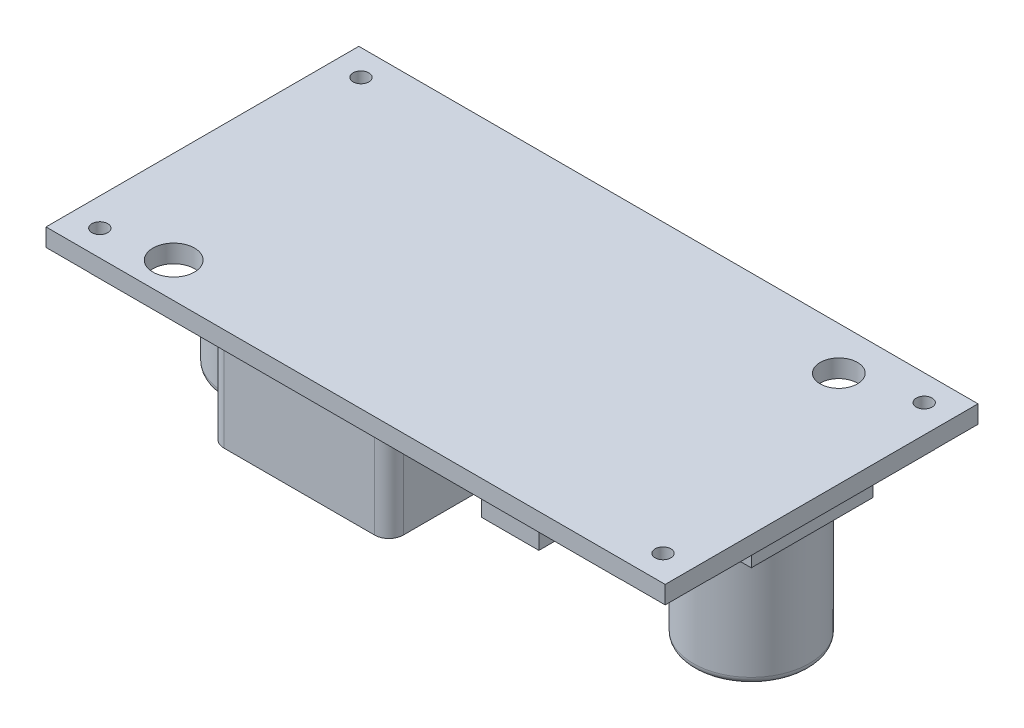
from build123d import *
from OCP.BRepFilletAPI import BRepFilletAPI_MakeChamfer

# Parameters (mm, degrees)
SKETCH1_W            = 43.15
SKETCH1_H            = 21.8
BOSS_EXTRUDE1_DEPTH  = 1.25
SKETCH2_R            = 0.55
CUT_EXTRUDE1_DEPTH   = 25.204403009
SKETCH3_R            = 1.3
SKETCH3_R_2          = 1.45
CUT_EXTRUDE2_DEPTH   = 25.204403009
SKETCH4_W            = 3
SKETCH4_H            = 3
CUT_EXTRUDE3_DEPTH   = 0.01
SKETCH5_W            = 0.089743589
SKETCH5_H            = 1
SKETCH5_W_2          = 0.384615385
SKETCH5_H_2          = 0.102564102
CUT_EXTRUDE4_DEPTH   = 0.01
SKETCH6_W            = 8.5
SKETCH6_H            = 8.5
BOSS_EXTRUDE2_DEPTH  = 1.75
SKETCH7_R            = 4.05
BOSS_EXTRUDE3_DEPTH  = 8.5
FILLET1_R            = 0.5
SKETCH8_W            = 12.5
SKETCH8_H            = 12.5
BOSS_EXTRUDE4_DEPTH  = 7.1
FILLET2_R            = 1
BOSS_EXTRUDE5_DEPTH  = 10
SKETCH10_W           = 4
SKETCH10_H           = 2.5
BOSS_EXTRUDE6_DEPTH  = 2.3
SKETCH11_W           = 10
SKETCH11_H           = 8.4
BOSS_EXTRUDE7_DEPTH  = 4.3
CHAMFER1_SIZE        = 2
CHAMFER1_SIZE2       = 0.727940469
SKETCH12_W           = 10
SKETCH12_H           = 1.5
BOSS_EXTRUDE8_DEPTH  = 1
SKETCH13_W           = 1
SKETCH13_H           = 5
BOSS_EXTRUDE9_DEPTH  = 1
LPATTERN1_COUNT      = 5
LPATTERN1_PITCH      = 1.9
SKETCH14_R           = 1.15
BOSS_EXTRUDE10_DEPTH = 1.6


with BuildPart() as part:
    # Sketch1 → Boss-Extrude1 (new body)
    with BuildSketch(Plane(origin=(0, 0, 0), x_dir=(1, 0, 0), z_dir=(0, 1, 0))):
        Rectangle(SKETCH1_W, SKETCH1_H)
    extrude(amount=BOSS_EXTRUDE1_DEPTH)

    # Sketch2 → Cut-Extrude1 (cut, through all)
    with BuildSketch(Plane(origin=(0, 1.25, 0), x_dir=(1, 0, 0), z_dir=(0, 1, 0))):
        with Locations(Location((19.625, 9.1, 0), (0, 0, 270))):
            Circle(SKETCH2_R)
        with Locations(Location((19.625, -9.1, 0), (0, 0, 270))):
            Circle(SKETCH2_R)
        with Locations(Location((-19.625, 9.1, 0), (0, 0, 270))):
            Circle(SKETCH2_R)
        with Locations(Location((-19.625, -9.1, 0), (0, 0, 270))):
            Circle(SKETCH2_R)
    extrude(amount=-CUT_EXTRUDE1_DEPTH, mode=Mode.SUBTRACT)

    # Sketch3 → Cut-Extrude2 (cut, through all)
    with BuildSketch(Plane(origin=(0, 1.25, 0), x_dir=(1, 0, 0), z_dir=(0, 1, 0))):
        with Locations(Location((14.875, 7.9, 0), (0, 0, 270))):
            Circle(SKETCH3_R)
        with Locations(Location((-15.125, -8.45, 0), (0, 0, 270))):
            Circle(SKETCH3_R_2)
    extrude(amount=-CUT_EXTRUDE2_DEPTH, mode=Mode.SUBTRACT)

    # Sketch4 → Cut-Extrude3 (cut)
    with BuildSketch(Plane.XZ):
        with Locations((20.075, -9.4)):
            Rectangle(SKETCH4_W, SKETCH4_H)
        with Locations((20.075, 9.4)):
            Rectangle(SKETCH4_W, SKETCH4_H)
        with Locations((-20.075, 9.4)):
            Rectangle(SKETCH4_W, SKETCH4_H)
        with Locations((-20.075, -9.4)):
            Rectangle(SKETCH4_W, SKETCH4_H)
    extrude(amount=-CUT_EXTRUDE3_DEPTH, mode=Mode.SUBTRACT)

    # Sketch5 → Cut-Extrude4 (cut)
    # profile 1 of 14: a face of its own
    with BuildSketch(Plane.XZ):
        with Locations((20.573564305, -7.20434754)):
            Rectangle(SKETCH5_W, SKETCH5_H)
    # profile 2 of 14: a face of its own
    with BuildSketch(Plane.XZ):
        Polygon((20.310743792, -6.70434754), (20.310743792, -7.70434754), (20.291913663, -7.70434754), (19.631256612, -6.917288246), (19.631256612, -7.70434754), (19.541513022, -7.70434754), (19.541513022, -6.70434754), (19.561945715, -6.70434754), (20.221000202, -7.489603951), (20.221000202, -6.70434754), align=None)
    # profile 3 of 14: a face of its own
    with BuildSketch(Plane.XZ):
        Polygon((19.041513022, -7.242809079), (19.041513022, -7.537680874), (18.951769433, -7.537680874), (18.951769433, -7.242809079), (18.656897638, -7.242809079), (18.656897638, -7.153065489), (18.951769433, -7.153065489), (18.951769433, -6.858193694), (19.041513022, -6.858193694), (19.041513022, -7.153065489), (19.336384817, -7.153065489), (19.336384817, -7.242809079), align=None)
    # profile 4 of 14: a face of its own
    with BuildSketch(Plane.XZ):
        with Locations((20.573564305, 7.050014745)):
            Rectangle(SKETCH5_W, SKETCH5_H)
    # profile 5 of 14: a face of its own
    with BuildSketch(Plane.XZ):
        Polygon((20.310743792, 7.550014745), (20.310743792, 6.550014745), (20.291913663, 6.550014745), (19.631256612, 7.337074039), (19.631256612, 6.550014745), (19.541513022, 6.550014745), (19.541513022, 7.550014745), (19.561945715, 7.550014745), (20.221000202, 6.764758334), (20.221000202, 7.550014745), align=None)
    # profile 6 of 14: a face of its own
    with BuildSketch(Plane.XZ):
        with Locations((19.182538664, 7.16539936)):
            Rectangle(SKETCH5_W_2, SKETCH5_H_2)
    # profile 7 of 14: a face of its own
    with BuildSketch(Plane.XZ):
        with BuildLine():
            add(Edge.make_bspline(
                [(-18.368582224, -7.729988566), (-18.38710084, -7.729527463), (-18.423472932, -7.728621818), (-18.476879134, -7.721460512), (-18.528017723, -7.709673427), (-18.576919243, -7.693028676), (-18.623393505, -7.671446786), (-18.667587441, -7.645245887), (-18.709349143, -7.614168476), (-18.748570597, -7.578952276), (-18.784219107, -7.540242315), (-18.815239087, -7.498684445), (-18.841639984, -7.45511511), (-18.86321046, -7.409250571), (-18.880159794, -7.361295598), (-18.891849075, -7.310964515), (-18.89931763, -7.258591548), (-18.900190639, -7.222869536), (-18.900633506, -7.204748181)],
                knots=[0, 0, 0, 0, 1.065027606, 2.091802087, 3.093458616, 4.079833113, 5.057734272, 6.036020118, 7.030157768, 8.047461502, 9.064242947, 10.052216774, 11.02588392, 11.989864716, 12.962978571, 13.945936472, 14.957997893, 16, 16, 16, 16], degree=3))
            add(Edge.make_bspline(
                [(-18.900633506, -7.204748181), (-18.90019049, -7.186760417), (-18.899317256, -7.15130445), (-18.891843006, -7.099262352), (-18.880107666, -7.04924053), (-18.863420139, -7.001355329), (-18.841833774, -6.955583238), (-18.815391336, -6.911983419), (-18.784441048, -6.870304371), (-18.748938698, -6.831405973), (-18.710169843, -6.795754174), (-18.668868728, -6.764237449), (-18.625085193, -6.737982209), (-18.579502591, -6.716089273), (-18.531667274, -6.699508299), (-18.481916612, -6.687425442), (-18.429968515, -6.680032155), (-18.394581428, -6.679153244), (-18.376595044, -6.678706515)],
                knots=[0, 0, 0, 0, 1.043683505, 2.0572211, 3.045299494, 4.022276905, 4.994977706, 5.977452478, 6.97747046, 8.003698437, 9.029677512, 10.031249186, 11.013723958, 11.988083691, 12.9614021, 13.946617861, 14.956316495, 16, 16, 16, 16], degree=3))
            add(Edge.make_bspline(
                [(-18.376595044, -6.678706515), (-18.358473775, -6.679149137), (-18.322751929, -6.680021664), (-18.270313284, -6.687502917), (-18.219946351, -6.699197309), (-18.171806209, -6.715925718), (-18.125877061, -6.737463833), (-18.082163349, -6.763930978), (-18.040612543, -6.795118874), (-18.001647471, -6.830593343), (-17.966038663, -6.869287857), (-17.93471866, -6.910534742), (-17.908404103, -6.953941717), (-17.886856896, -6.99932985), (-17.869813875, -7.04658182), (-17.85818285, -7.09599486), (-17.850658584, -7.147292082), (-17.849791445, -7.182218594), (-17.849351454, -7.199940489)],
                knots=[0, 0, 0, 0, 1.053167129, 2.076072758, 3.073341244, 4.055601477, 5.033424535, 6.017524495, 7.021518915, 8.049444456, 9.077120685, 10.074910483, 11.055688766, 12.022980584, 12.991883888, 13.970269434, 14.970104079, 16, 16, 16, 16], degree=3))
            add(Edge.make_bspline(
                [(-17.849351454, -7.199940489), (-17.849504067, -7.211835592), (-17.849807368, -7.235475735), (-17.853464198, -7.270579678), (-17.858759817, -7.305122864), (-17.866388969, -7.338989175), (-17.876229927, -7.372184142), (-17.888357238, -7.404639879), (-17.902255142, -7.436623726), (-17.918802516, -7.467526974), (-17.936856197, -7.497398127), (-17.956541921, -7.525863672), (-17.977996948, -7.552415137), (-18.000914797, -7.577479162), (-18.025612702, -7.60062796), (-18.051718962, -7.622366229), (-18.079370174, -7.642468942), (-18.108610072, -7.660513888), (-18.138693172, -7.677088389), (-18.169837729, -7.690926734), (-18.201386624, -7.703157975), (-18.233617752, -7.712878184), (-18.266456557, -7.720613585), (-18.299944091, -7.725869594), (-18.334045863, -7.729534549), (-18.357020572, -7.729836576), (-18.368582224, -7.729988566)],
                knots=[0, 0, 0, 0, 1.037115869, 2.061148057, 3.07517727, 4.084041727, 5.086514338, 6.092668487, 7.104487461, 8.125783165, 9.147610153, 10.147694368, 11.141876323, 12.122903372, 13.107606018, 14.091946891, 15.084523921, 16.086505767, 17.087268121, 18.077809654, 19.05670789, 20.036870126, 21.011670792, 21.99694167, 22.991993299, 24, 24, 24, 24], degree=3))
        make_face()
        with BuildLine():
            add(Edge.make_bspline(
                [(-18.372989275, -7.627424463), (-18.363499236, -7.627309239), (-18.344609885, -7.627079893), (-18.316530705, -7.624040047), (-18.288810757, -7.619742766), (-18.26151094, -7.613485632), (-18.234606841, -7.605468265), (-18.208068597, -7.595567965), (-18.18187251, -7.584010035), (-18.156258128, -7.570593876), (-18.131634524, -7.555555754), (-18.107853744, -7.539700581), (-18.085824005, -7.522129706), (-18.065119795, -7.503494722), (-18.045791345, -7.483539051), (-18.027836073, -7.462409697), (-18.011271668, -7.440011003), (-17.996296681, -7.416436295), (-17.982970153, -7.391816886), (-17.971038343, -7.366623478), (-17.96114733, -7.340559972), (-17.953312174, -7.31378902), (-17.946661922, -7.286428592), (-17.942490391, -7.25832962), (-17.939421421, -7.229588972), (-17.939204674, -7.210165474), (-17.939095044, -7.20034113)],
                knots=[0, 0, 0, 0, 1.008431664, 2.007222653, 2.999229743, 3.989431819, 4.982149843, 5.98167215, 6.998687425, 8.024288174, 9.053028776, 10.065052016, 11.06063401, 12.045759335, 13.024701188, 14.011819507, 14.991481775, 15.984022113, 16.97831254, 17.965966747, 18.945551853, 19.938269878, 20.93007375, 21.936103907, 22.956087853, 24, 24, 24, 24], degree=3))
            add(Edge.make_bspline(
                [(-17.939095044, -7.20034113), (-17.939460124, -7.18589511), (-17.940178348, -7.157475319), (-17.946440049, -7.115822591), (-17.956161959, -7.075753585), (-17.970256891, -7.037507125), (-17.988237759, -7.000912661), (-18.010170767, -6.966112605), (-18.036256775, -6.933117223), (-18.065870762, -6.902172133), (-18.098252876, -6.873938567), (-18.132621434, -6.849121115), (-18.168704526, -6.828234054), (-18.206294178, -6.810772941), (-18.245711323, -6.797618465), (-18.286703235, -6.78823933), (-18.329270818, -6.782160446), (-18.35827816, -6.781570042), (-18.372989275, -6.781270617)],
                knots=[0, 0, 0, 0, 1.032022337, 2.030307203, 3.003823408, 3.974715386, 4.937372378, 5.913284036, 6.909147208, 7.938749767, 8.970518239, 9.975863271, 10.963918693, 11.946286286, 12.933361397, 13.927862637, 14.949112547, 16, 16, 16, 16], degree=3))
            add(Edge.make_bspline(
                [(-18.372989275, -6.781270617), (-18.382877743, -6.781406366), (-18.402489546, -6.781675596), (-18.43165912, -6.784391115), (-18.460305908, -6.788737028), (-18.488376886, -6.795025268), (-18.515909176, -6.802790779), (-18.542818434, -6.812424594), (-18.569100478, -6.823967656), (-18.594866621, -6.836852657), (-18.619558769, -6.851384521), (-18.642896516, -6.867351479), (-18.665033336, -6.884326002), (-18.685699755, -6.902826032), (-18.704947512, -6.922613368), (-18.722581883, -6.943832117), (-18.739138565, -6.966063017), (-18.754008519, -6.989631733), (-18.767517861, -7.014056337), (-18.779099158, -7.039323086), (-18.788995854, -7.065271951), (-18.79697217, -7.091928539), (-18.803226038, -7.119231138), (-18.807534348, -7.147219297), (-18.810548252, -7.175836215), (-18.810775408, -7.195191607), (-18.810889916, -7.204948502)],
                knots=[0, 0, 0, 0, 1.047362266, 2.077233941, 3.100744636, 4.115120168, 5.122788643, 6.129711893, 7.140355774, 8.162227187, 9.180148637, 10.17298275, 11.156396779, 12.133377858, 13.108923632, 14.078087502, 15.054351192, 16.043448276, 17.028082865, 18.009331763, 18.985518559, 19.968016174, 20.954783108, 21.950335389, 22.966780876, 24, 24, 24, 24], degree=3))
            add(Edge.make_bspline(
                [(-18.810889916, -7.204948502), (-18.810775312, -7.214638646), (-18.810547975, -7.233860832), (-18.807535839, -7.262278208), (-18.803221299, -7.29006484), (-18.797003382, -7.317111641), (-18.788989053, -7.343425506), (-18.779106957, -7.368981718), (-18.767454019, -7.393875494), (-18.754080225, -7.41804527), (-18.73904719, -7.441238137), (-18.722620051, -7.463409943), (-18.704516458, -7.484146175), (-18.685248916, -7.503951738), (-18.664354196, -7.522430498), (-18.641828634, -7.539510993), (-18.618233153, -7.555963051), (-18.593033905, -7.570522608), (-18.56712142, -7.584038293), (-18.54050506, -7.595559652), (-18.513517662, -7.605512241), (-18.48612318, -7.613451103), (-18.458368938, -7.619748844), (-18.430247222, -7.62403849), (-18.401768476, -7.627080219), (-18.382612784, -7.627309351), (-18.372989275, -7.627424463)],
                knots=[0, 0, 0, 0, 1.02988216, 2.042960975, 3.035124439, 4.018561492, 4.99104521, 5.957523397, 6.929462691, 7.91146347, 8.892205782, 9.866320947, 10.842813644, 11.816825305, 12.802668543, 13.805243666, 14.821427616, 15.858893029, 16.897256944, 17.927432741, 18.940436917, 19.95373962, 20.957947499, 21.96413624, 22.977215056, 24, 24, 24, 24], degree=3))
        make_face(mode=Mode.SUBTRACT)
    # profile 8 of 14: a face of its own
    with BuildSketch(Plane.XZ):
        with BuildLine():
            Line((-19.105761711, -7.70434754), (-19.195505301, -7.70434754))
            Line((-19.195505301, -7.70434754), (-19.195505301, -7.105188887))
            add(Edge.make_bspline(
                [(-19.195505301, -7.105188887), (-19.195491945, -7.096708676), (-19.195466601, -7.080616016), (-19.195635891, -7.057710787), (-19.196109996, -7.037347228), (-19.196408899, -7.019446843), (-19.197073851, -7.004091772), (-19.19761615, -6.991198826), (-19.198313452, -6.980829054), (-19.199151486, -6.974777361), (-19.199511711, -6.972176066)],
                knots=[0, 0, 0, 0, 1.528628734, 2.90083645, 4.128790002, 5.200304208, 6.127813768, 6.898992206, 7.526736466, 8, 8, 8, 8], degree=3))
            add(Edge.make_bspline(
                [(-19.199511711, -6.972176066), (-19.200972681, -6.96271849), (-19.203793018, -6.944461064), (-19.211313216, -6.918494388), (-19.221256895, -6.894967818), (-19.233929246, -6.873618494), (-19.249558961, -6.854296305), (-19.268842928, -6.836815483), (-19.291741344, -6.821125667), (-19.317733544, -6.80736291), (-19.345445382, -6.795948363), (-19.373862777, -6.787403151), (-19.402442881, -6.782174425), (-19.421579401, -6.78157051), (-19.431082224, -6.781270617)],
                knots=[0, 0, 0, 0, 1.042923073, 2.013316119, 2.939979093, 3.821796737, 4.712412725, 5.640305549, 6.650442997, 7.732186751, 8.842579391, 9.91407549, 10.964170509, 12, 12, 12, 12], degree=3))
            add(Edge.make_bspline(
                [(-19.431082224, -6.781270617), (-19.439241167, -6.781575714), (-19.45551193, -6.782184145), (-19.479674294, -6.785998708), (-19.503282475, -6.792736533), (-19.526145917, -6.801919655), (-19.547912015, -6.813194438), (-19.567995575, -6.82679489), (-19.586185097, -6.842406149), (-19.602588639, -6.859955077), (-19.616866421, -6.879549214), (-19.629157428, -6.901086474), (-19.639199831, -6.924738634), (-19.644244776, -6.941407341), (-19.646827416, -6.949940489)],
                knots=[0, 0, 0, 0, 0.994543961, 1.983343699, 2.972712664, 3.980751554, 4.981834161, 5.954730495, 6.930176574, 7.89761099, 8.875938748, 9.87834379, 10.913868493, 12, 12, 12, 12], degree=3))
            add(Edge.make_bspline(
                [(-19.646827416, -6.949940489), (-19.647684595, -6.953468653), (-19.649594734, -6.961330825), (-19.651379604, -6.974622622), (-19.653238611, -6.990305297), (-19.654528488, -7.00849153), (-19.65578598, -7.029120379), (-19.656538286, -7.05229931), (-19.65688601, -7.077944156), (-19.656989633, -7.095840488), (-19.657043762, -7.105188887)],
                knots=[0, 0, 0, 0, 0.558680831, 1.244966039, 2.062412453, 2.990489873, 4.051219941, 5.244515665, 6.560634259, 8, 8, 8, 8], degree=3))
            Line((-19.657043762, -7.105188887), (-19.657043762, -7.70434754))
            Line((-19.657043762, -7.70434754), (-19.746787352, -7.70434754))
            Line((-19.746787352, -7.70434754), (-19.746787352, -7.100381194))
            add(Edge.make_bspline(
                [(-19.746787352, -7.100381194), (-19.746715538, -7.089495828), (-19.74657539, -7.068252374), (-19.745335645, -7.037125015), (-19.743415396, -7.007589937), (-19.740514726, -6.979684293), (-19.737305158, -6.95337668), (-19.732751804, -6.928763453), (-19.727909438, -6.905635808), (-19.721832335, -6.883951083), (-19.714603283, -6.863382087), (-19.705994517, -6.84354031), (-19.695509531, -6.824604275), (-19.683641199, -6.806226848), (-19.670146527, -6.788577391), (-19.655140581, -6.771518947), (-19.638383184, -6.755275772), (-19.620296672, -6.739770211), (-19.601027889, -6.725247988), (-19.580360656, -6.712883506), (-19.558664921, -6.702419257), (-19.536170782, -6.693506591), (-19.512498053, -6.686989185), (-19.487941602, -6.682096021), (-19.462328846, -6.679327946), (-19.444910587, -6.678915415), (-19.436090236, -6.678706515)],
                knots=[0, 0, 0, 0, 1.316485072, 2.56920066, 3.767172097, 4.895413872, 5.962239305, 6.971350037, 7.921780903, 8.819233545, 9.69278517, 10.557066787, 11.431700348, 12.307563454, 13.200791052, 14.11626757, 15.05287325, 16.020813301, 16.99640464, 17.967304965, 18.928075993, 19.907403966, 20.889159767, 21.893313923, 22.933205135, 24, 24, 24, 24], degree=3))
            add(Edge.make_bspline(
                [(-19.436090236, -6.678706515), (-19.426470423, -6.678930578), (-19.407596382, -6.679370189), (-19.379786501, -6.681893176), (-19.353121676, -6.686633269), (-19.327341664, -6.692707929), (-19.302695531, -6.700949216), (-19.279190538, -6.711075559), (-19.256556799, -6.722636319), (-19.235304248, -6.736297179), (-19.215258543, -6.751193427), (-19.19704158, -6.767555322), (-19.18019092, -6.78475972), (-19.165449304, -6.803454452), (-19.152259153, -6.823256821), (-19.14091112, -6.844259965), (-19.131163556, -6.86643573), (-19.126133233, -6.881851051), (-19.123590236, -6.889644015)],
                knots=[0, 0, 0, 0, 1.138939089, 2.234594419, 3.301501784, 4.342532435, 5.367382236, 6.373123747, 7.370098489, 8.372230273, 9.360297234, 10.323289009, 11.268038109, 12.20748145, 13.137029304, 14.081414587, 15.030090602, 16, 16, 16, 16], degree=3))
            add(Edge.make_bspline(
                [(-19.123590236, -6.889644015), (-19.122111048, -6.894967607), (-19.118902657, -6.906514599), (-19.115466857, -6.925625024), (-19.112578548, -6.947629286), (-19.109862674, -6.972528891), (-19.108260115, -7.000343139), (-19.106855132, -7.031059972), (-19.105751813, -7.064716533), (-19.105758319, -7.08816068), (-19.105761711, -7.100381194)],
                knots=[0, 0, 0, 0, 0.625038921, 1.35572334, 2.194682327, 3.136881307, 4.189498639, 5.346923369, 6.617055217, 8, 8, 8, 8], degree=3))
            Line((-19.105761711, -7.100381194), (-19.105761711, -7.70434754))
        make_face()
    # profile 9 of 14: a face of its own
    with BuildSketch(Plane.XZ):
        Polygon((-19.900633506, -7.601783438), (-19.900633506, -7.70434754), (-20.426274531, -7.70434754), (-20.426274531, -7.601783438), (-20.208325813, -7.601783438), (-20.208325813, -6.70434754), (-20.118582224, -6.70434754), (-20.118582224, -7.601783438), align=None)
    # profile 10 of 14: a face of its own
    with BuildSketch(Plane.XZ):
        Polygon((-20.849351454, -7.242809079), (-20.849351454, -7.537680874), (-20.939095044, -7.537680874), (-20.939095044, -7.242809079), (-21.233966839, -7.242809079), (-21.233966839, -7.153065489), (-20.939095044, -7.153065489), (-20.939095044, -6.858193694), (-20.849351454, -6.858193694), (-20.849351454, -7.153065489), (-20.554479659, -7.153065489), (-20.554479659, -7.242809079), align=None)
    # profile 11 of 14: a face of its own
    with BuildSketch(Plane.XZ):
        with BuildLine():
            add(Edge.make_bspline(
                [(-18.368582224, 6.524373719), (-18.38710084, 6.524834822), (-18.423472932, 6.525740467), (-18.476879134, 6.532901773), (-18.528017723, 6.544688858), (-18.576919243, 6.561333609), (-18.623393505, 6.582915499), (-18.667587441, 6.609116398), (-18.709349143, 6.640193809), (-18.748570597, 6.675410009), (-18.784219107, 6.71411997), (-18.815239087, 6.75567784), (-18.841639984, 6.799247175), (-18.86321046, 6.845111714), (-18.880159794, 6.893066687), (-18.891849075, 6.94339777), (-18.89931763, 6.995770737), (-18.900190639, 7.031492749), (-18.900633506, 7.049614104)],
                knots=[0, 0, 0, 0, 1.065027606, 2.091802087, 3.093458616, 4.079833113, 5.057734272, 6.036020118, 7.030157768, 8.047461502, 9.064242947, 10.052216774, 11.02588392, 11.989864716, 12.962978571, 13.945936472, 14.957997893, 16, 16, 16, 16], degree=3))
            add(Edge.make_bspline(
                [(-18.900633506, 7.049614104), (-18.90019049, 7.067601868), (-18.899317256, 7.103057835), (-18.891843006, 7.155099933), (-18.880107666, 7.205121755), (-18.863420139, 7.253006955), (-18.841833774, 7.298779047), (-18.815391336, 7.342378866), (-18.784441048, 7.384057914), (-18.748938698, 7.422956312), (-18.710169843, 7.458608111), (-18.668868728, 7.490124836), (-18.625085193, 7.516380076), (-18.579502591, 7.538273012), (-18.531667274, 7.554853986), (-18.481916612, 7.566936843), (-18.429968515, 7.57433013), (-18.394581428, 7.575209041), (-18.376595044, 7.57565577)],
                knots=[0, 0, 0, 0, 1.043683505, 2.0572211, 3.045299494, 4.022276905, 4.994977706, 5.977452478, 6.97747046, 8.003698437, 9.029677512, 10.031249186, 11.013723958, 11.988083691, 12.9614021, 13.946617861, 14.956316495, 16, 16, 16, 16], degree=3))
            add(Edge.make_bspline(
                [(-18.376595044, 7.57565577), (-18.358473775, 7.575213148), (-18.322751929, 7.574340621), (-18.270313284, 7.566859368), (-18.219946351, 7.555164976), (-18.171806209, 7.538436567), (-18.125877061, 7.516898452), (-18.082163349, 7.490431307), (-18.040612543, 7.459243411), (-18.001647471, 7.423768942), (-17.966038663, 7.385074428), (-17.93471866, 7.343827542), (-17.908404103, 7.300420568), (-17.886856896, 7.255032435), (-17.869813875, 7.207780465), (-17.85818285, 7.158367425), (-17.850658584, 7.107070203), (-17.849791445, 7.072143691), (-17.849351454, 7.054421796)],
                knots=[0, 0, 0, 0, 1.053167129, 2.076072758, 3.073341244, 4.055601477, 5.033424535, 6.017524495, 7.021518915, 8.049444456, 9.077120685, 10.074910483, 11.055688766, 12.022980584, 12.991883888, 13.970269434, 14.970104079, 16, 16, 16, 16], degree=3))
            add(Edge.make_bspline(
                [(-17.849351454, 7.054421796), (-17.849504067, 7.042526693), (-17.849807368, 7.01888655), (-17.853464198, 6.983782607), (-17.858759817, 6.949239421), (-17.866388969, 6.91537311), (-17.876229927, 6.882178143), (-17.888357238, 6.849722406), (-17.902255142, 6.817738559), (-17.918802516, 6.786835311), (-17.936856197, 6.756964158), (-17.956541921, 6.728498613), (-17.977996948, 6.701947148), (-18.000914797, 6.676883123), (-18.025612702, 6.653734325), (-18.051718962, 6.631996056), (-18.079370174, 6.611893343), (-18.108610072, 6.593848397), (-18.138693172, 6.577273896), (-18.169837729, 6.563435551), (-18.201386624, 6.55120431), (-18.233617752, 6.541484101), (-18.266456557, 6.5337487), (-18.299944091, 6.528492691), (-18.334045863, 6.524827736), (-18.357020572, 6.524525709), (-18.368582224, 6.524373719)],
                knots=[0, 0, 0, 0, 1.037115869, 2.061148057, 3.07517727, 4.084041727, 5.086514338, 6.092668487, 7.104487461, 8.125783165, 9.147610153, 10.147694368, 11.141876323, 12.122903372, 13.107606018, 14.091946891, 15.084523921, 16.086505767, 17.087268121, 18.077809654, 19.05670789, 20.036870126, 21.011670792, 21.99694167, 22.991993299, 24, 24, 24, 24], degree=3))
        make_face()
        with BuildLine():
            add(Edge.make_bspline(
                [(-18.372989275, 6.626937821), (-18.363499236, 6.627053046), (-18.344609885, 6.627282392), (-18.316530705, 6.630322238), (-18.288810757, 6.634619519), (-18.26151094, 6.640876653), (-18.234606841, 6.64889402), (-18.208068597, 6.65879432), (-18.18187251, 6.67035225), (-18.156258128, 6.683768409), (-18.131634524, 6.698806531), (-18.107853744, 6.714661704), (-18.085824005, 6.732232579), (-18.065119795, 6.750867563), (-18.045791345, 6.770823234), (-18.027836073, 6.791952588), (-18.011271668, 6.814351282), (-17.996296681, 6.83792599), (-17.982970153, 6.862545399), (-17.971038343, 6.887738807), (-17.96114733, 6.913802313), (-17.953312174, 6.940573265), (-17.946661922, 6.967933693), (-17.942490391, 6.996032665), (-17.939421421, 7.024773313), (-17.939204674, 7.044196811), (-17.939095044, 7.054021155)],
                knots=[0, 0, 0, 0, 1.008431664, 2.007222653, 2.999229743, 3.989431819, 4.982149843, 5.98167215, 6.998687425, 8.024288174, 9.053028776, 10.065052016, 11.06063401, 12.045759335, 13.024701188, 14.011819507, 14.991481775, 15.984022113, 16.97831254, 17.965966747, 18.945551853, 19.938269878, 20.93007375, 21.936103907, 22.956087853, 24, 24, 24, 24], degree=3))
            add(Edge.make_bspline(
                [(-17.939095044, 7.054021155), (-17.939460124, 7.068467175), (-17.940178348, 7.096886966), (-17.946440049, 7.138539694), (-17.956161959, 7.1786087), (-17.970256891, 7.21685516), (-17.988237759, 7.253449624), (-18.010170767, 7.28824968), (-18.036256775, 7.321245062), (-18.065870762, 7.352190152), (-18.098252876, 7.380423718), (-18.132621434, 7.40524117), (-18.168704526, 7.426128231), (-18.206294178, 7.443589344), (-18.245711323, 7.45674382), (-18.286703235, 7.466122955), (-18.329270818, 7.472201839), (-18.35827816, 7.472792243), (-18.372989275, 7.473091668)],
                knots=[0, 0, 0, 0, 1.032022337, 2.030307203, 3.003823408, 3.974715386, 4.937372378, 5.913284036, 6.909147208, 7.938749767, 8.970518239, 9.975863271, 10.963918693, 11.946286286, 12.933361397, 13.927862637, 14.949112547, 16, 16, 16, 16], degree=3))
            add(Edge.make_bspline(
                [(-18.372989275, 7.473091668), (-18.382877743, 7.472955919), (-18.402489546, 7.472686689), (-18.43165912, 7.46997117), (-18.460305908, 7.465625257), (-18.488376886, 7.459337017), (-18.515909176, 7.451571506), (-18.542818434, 7.441937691), (-18.569100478, 7.430394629), (-18.594866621, 7.417509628), (-18.619558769, 7.402977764), (-18.642896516, 7.387010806), (-18.665033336, 7.370036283), (-18.685699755, 7.351536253), (-18.704947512, 7.331748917), (-18.722581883, 7.310530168), (-18.739138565, 7.288299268), (-18.754008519, 7.264730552), (-18.767517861, 7.240305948), (-18.779099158, 7.215039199), (-18.788995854, 7.189090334), (-18.79697217, 7.162433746), (-18.803226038, 7.135131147), (-18.807534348, 7.107142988), (-18.810548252, 7.07852607), (-18.810775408, 7.059170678), (-18.810889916, 7.049413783)],
                knots=[0, 0, 0, 0, 1.047362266, 2.077233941, 3.100744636, 4.115120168, 5.122788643, 6.129711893, 7.140355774, 8.162227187, 9.180148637, 10.17298275, 11.156396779, 12.133377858, 13.108923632, 14.078087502, 15.054351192, 16.043448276, 17.028082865, 18.009331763, 18.985518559, 19.968016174, 20.954783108, 21.950335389, 22.966780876, 24, 24, 24, 24], degree=3))
            add(Edge.make_bspline(
                [(-18.810889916, 7.049413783), (-18.810775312, 7.039723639), (-18.810547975, 7.020501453), (-18.807535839, 6.992084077), (-18.803221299, 6.964297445), (-18.797003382, 6.937250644), (-18.788989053, 6.910936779), (-18.779106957, 6.885380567), (-18.767454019, 6.860486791), (-18.754080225, 6.836317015), (-18.73904719, 6.813124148), (-18.722620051, 6.790952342), (-18.704516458, 6.77021611), (-18.685248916, 6.750410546), (-18.664354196, 6.731931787), (-18.641828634, 6.714851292), (-18.618233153, 6.698399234), (-18.593033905, 6.683839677), (-18.56712142, 6.670323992), (-18.54050506, 6.658802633), (-18.513517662, 6.648850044), (-18.48612318, 6.640911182), (-18.458368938, 6.634613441), (-18.430247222, 6.630323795), (-18.401768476, 6.627282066), (-18.382612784, 6.627052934), (-18.372989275, 6.626937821)],
                knots=[0, 0, 0, 0, 1.02988216, 2.042960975, 3.035124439, 4.018561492, 4.99104521, 5.957523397, 6.929462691, 7.91146347, 8.892205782, 9.866320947, 10.842813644, 11.816825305, 12.802668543, 13.805243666, 14.821427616, 15.858893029, 16.897256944, 17.927432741, 18.940436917, 19.95373962, 20.957947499, 21.96413624, 22.977215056, 24, 24, 24, 24], degree=3))
        make_face(mode=Mode.SUBTRACT)
    # profile 12 of 14: a face of its own
    with BuildSketch(Plane.XZ):
        with BuildLine():
            Line((-19.105761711, 6.550014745), (-19.195505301, 6.550014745))
            Line((-19.195505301, 6.550014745), (-19.195505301, 7.149173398))
            add(Edge.make_bspline(
                [(-19.195505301, 7.149173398), (-19.195491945, 7.157653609), (-19.195466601, 7.173746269), (-19.195635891, 7.196651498), (-19.196109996, 7.217015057), (-19.196408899, 7.234915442), (-19.197073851, 7.250270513), (-19.19761615, 7.263163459), (-19.198313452, 7.273533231), (-19.199151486, 7.279584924), (-19.199511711, 7.282186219)],
                knots=[0, 0, 0, 0, 1.528628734, 2.90083645, 4.128790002, 5.200304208, 6.127813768, 6.898992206, 7.526736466, 8, 8, 8, 8], degree=3))
            add(Edge.make_bspline(
                [(-19.199511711, 7.282186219), (-19.200972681, 7.291643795), (-19.203793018, 7.309901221), (-19.211313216, 7.335867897), (-19.221256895, 7.359394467), (-19.233929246, 7.380743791), (-19.249558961, 7.40006598), (-19.268842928, 7.417546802), (-19.291741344, 7.433236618), (-19.317733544, 7.446999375), (-19.345445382, 7.458413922), (-19.373862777, 7.466959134), (-19.402442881, 7.47218786), (-19.421579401, 7.472791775), (-19.431082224, 7.473091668)],
                knots=[0, 0, 0, 0, 1.042923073, 2.013316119, 2.939979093, 3.821796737, 4.712412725, 5.640305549, 6.650442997, 7.732186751, 8.842579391, 9.91407549, 10.964170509, 12, 12, 12, 12], degree=3))
            add(Edge.make_bspline(
                [(-19.431082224, 7.473091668), (-19.439241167, 7.472786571), (-19.45551193, 7.47217814), (-19.479674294, 7.468363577), (-19.503282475, 7.461625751), (-19.526145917, 7.45244263), (-19.547912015, 7.441167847), (-19.567995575, 7.427567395), (-19.586185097, 7.411956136), (-19.602588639, 7.394407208), (-19.616866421, 7.374813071), (-19.629157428, 7.353275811), (-19.639199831, 7.329623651), (-19.644244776, 7.312954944), (-19.646827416, 7.304421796)],
                knots=[0, 0, 0, 0, 0.994543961, 1.983343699, 2.972712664, 3.980751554, 4.981834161, 5.954730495, 6.930176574, 7.89761099, 8.875938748, 9.87834379, 10.913868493, 12, 12, 12, 12], degree=3))
            add(Edge.make_bspline(
                [(-19.646827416, 7.304421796), (-19.647684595, 7.300893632), (-19.649594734, 7.29303146), (-19.651379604, 7.279739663), (-19.653238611, 7.264056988), (-19.654528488, 7.245870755), (-19.65578598, 7.225241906), (-19.656538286, 7.202062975), (-19.65688601, 7.176418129), (-19.656989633, 7.158521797), (-19.657043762, 7.149173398)],
                knots=[0, 0, 0, 0, 0.558680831, 1.244966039, 2.062412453, 2.990489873, 4.051219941, 5.244515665, 6.560634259, 8, 8, 8, 8], degree=3))
            Line((-19.657043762, 7.149173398), (-19.657043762, 6.550014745))
            Line((-19.657043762, 6.550014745), (-19.746787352, 6.550014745))
            Line((-19.746787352, 6.550014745), (-19.746787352, 7.153981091))
            add(Edge.make_bspline(
                [(-19.746787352, 7.153981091), (-19.746715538, 7.164866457), (-19.74657539, 7.186109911), (-19.745335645, 7.21723727), (-19.743415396, 7.246772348), (-19.740514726, 7.274677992), (-19.737305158, 7.300985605), (-19.732751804, 7.325598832), (-19.727909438, 7.348726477), (-19.721832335, 7.370411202), (-19.714603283, 7.390980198), (-19.705994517, 7.410821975), (-19.695509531, 7.42975801), (-19.683641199, 7.448135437), (-19.670146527, 7.465784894), (-19.655140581, 7.482843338), (-19.638383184, 7.499086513), (-19.620296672, 7.514592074), (-19.601027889, 7.529114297), (-19.580360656, 7.541478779), (-19.558664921, 7.551943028), (-19.536170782, 7.560855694), (-19.512498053, 7.5673731), (-19.487941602, 7.572266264), (-19.462328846, 7.575034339), (-19.444910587, 7.57544687), (-19.436090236, 7.57565577)],
                knots=[0, 0, 0, 0, 1.316485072, 2.56920066, 3.767172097, 4.895413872, 5.962239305, 6.971350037, 7.921780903, 8.819233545, 9.69278517, 10.557066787, 11.431700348, 12.307563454, 13.200791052, 14.11626757, 15.05287325, 16.020813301, 16.99640464, 17.967304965, 18.928075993, 19.907403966, 20.889159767, 21.893313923, 22.933205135, 24, 24, 24, 24], degree=3))
            add(Edge.make_bspline(
                [(-19.436090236, 7.57565577), (-19.426470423, 7.575431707), (-19.407596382, 7.574992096), (-19.379786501, 7.572469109), (-19.353121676, 7.567729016), (-19.327341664, 7.561654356), (-19.302695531, 7.553413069), (-19.279190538, 7.543286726), (-19.256556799, 7.531725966), (-19.235304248, 7.518065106), (-19.215258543, 7.503168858), (-19.19704158, 7.486806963), (-19.18019092, 7.469602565), (-19.165449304, 7.450907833), (-19.152259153, 7.431105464), (-19.14091112, 7.41010232), (-19.131163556, 7.387926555), (-19.126133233, 7.372511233), (-19.123590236, 7.36471827)],
                knots=[0, 0, 0, 0, 1.138939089, 2.234594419, 3.301501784, 4.342532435, 5.367382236, 6.373123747, 7.370098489, 8.372230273, 9.360297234, 10.323289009, 11.268038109, 12.20748145, 13.137029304, 14.081414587, 15.030090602, 16, 16, 16, 16], degree=3))
            add(Edge.make_bspline(
                [(-19.123590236, 7.36471827), (-19.122111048, 7.359394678), (-19.118902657, 7.347847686), (-19.115466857, 7.328737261), (-19.112578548, 7.306732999), (-19.109862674, 7.281833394), (-19.108260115, 7.254019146), (-19.106855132, 7.223302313), (-19.105751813, 7.189645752), (-19.105758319, 7.166201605), (-19.105761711, 7.153981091)],
                knots=[0, 0, 0, 0, 0.625038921, 1.35572334, 2.194682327, 3.136881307, 4.189498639, 5.346923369, 6.617055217, 8, 8, 8, 8], degree=3))
            Line((-19.105761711, 7.153981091), (-19.105761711, 6.550014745))
        make_face()
    # profile 13 of 14: a face of its own
    with BuildSketch(Plane.XZ):
        Polygon((-19.900633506, 6.652578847), (-19.900633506, 6.550014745), (-20.426274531, 6.550014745), (-20.426274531, 6.652578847), (-20.208325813, 6.652578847), (-20.208325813, 7.550014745), (-20.118582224, 7.550014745), (-20.118582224, 6.652578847), align=None)
    # profile 14 of 14: a face of its own
    with BuildSketch(Plane.XZ):
        with Locations((-20.708325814, 7.16539936)):
            Rectangle(SKETCH5_W_2, SKETCH5_H_2)
    extrude(amount=-CUT_EXTRUDE4_DEPTH, mode=Mode.SUBTRACT)

    # Sketch6 → Boss-Extrude2 (add)
    with BuildSketch(Plane.XZ):
        with Locations((16.325, -0.35)):
            Rectangle(SKETCH6_W, SKETCH6_H)
        with Locations((-16.325, -0.35)):
            Rectangle(SKETCH6_W, SKETCH6_H)
    extrude(amount=BOSS_EXTRUDE2_DEPTH)

    # Sketch7 → Boss-Extrude3 (add)
    with BuildSketch(Plane.XZ.offset(1.75)):
        with Locations(Location((-16.325, -0.35, 0), (0, 0, 270))):
            Circle(SKETCH7_R)
        with Locations(Location((16.325, -0.35, 0), (0, 0, 270))):
            Circle(SKETCH7_R)
    extrude(amount=BOSS_EXTRUDE3_DEPTH)

    # Fillet1
    fillet1_edges = [part.edges().sort_by_distance(p)[0] for p in [
        (-16.325, -10.25, 3.7),
        (16.325, -10.25, 3.7),
    ]]
    fillet(fillet1_edges, radius=FILLET1_R)

    # Sketch8 → Boss-Extrude4 (add)
    with BuildSketch(Plane.XZ):
        with Locations((-5.125, 3.45)):
            Rectangle(SKETCH8_W, SKETCH8_H)
    extrude(amount=BOSS_EXTRUDE4_DEPTH)

    # Fillet2
    fillet2_edges = [part.edges().sort_by_distance(p)[0] for p in [
        (-11.375, -3.55, 9.7),
        (-11.375, -3.55, -2.8),
        (1.125, -3.55, -2.8),
        (1.125, -3.55, 9.7),
    ]]
    fillet(fillet2_edges, radius=FILLET2_R)

    # Sketch9 → Boss-Extrude5 (add)
    with BuildSketch(Plane.XZ):
        Polygon((-10.225, -4.5), (-10.225, -5.2), (-2.125, -5.2), (-2.125, -4.5), (-1.425, -4.5), (-1.425, -9.5), (-10.925, -9.5), (-10.925, -4.5), align=None)
    extrude(amount=BOSS_EXTRUDE5_DEPTH)

    # Sketch10 → Boss-Extrude6 (add)
    with BuildSketch(Plane.XZ):
        with Locations((9.575, 8.45)):
            Rectangle(SKETCH10_W, SKETCH10_H)
    extrude(amount=BOSS_EXTRUDE6_DEPTH)

    # Sketch11 → Boss-Extrude7 (add)
    with BuildSketch(Plane.XZ):
        with Locations((6.625, -3.6)):
            Rectangle(SKETCH11_W, SKETCH11_H)
    extrude(amount=BOSS_EXTRUDE7_DEPTH)

    # Chamfer1: one chamfer whose edges measure the first distance from different faces: ONE call of the kernel's chamfer builder (chamfer() names one face for all edges)
    chamfer1_edges_1 = [part.edges().sort_by_distance(p)[0] for p in [
        (6.625, -4.3, -7.8),
    ]]
    chamfer1_side_1 = [part.faces().sort_by_distance(p)[0] for p in [
        (6.625, -2.15, -7.8),
    ]]
    chamfer1_edges_2 = [part.edges().sort_by_distance(p)[0] for p in [
        (6.625, -4.3, 0.6),
    ]]
    chamfer1_side_2 = [part.faces().sort_by_distance(p)[0] for p in [
        (6.625, -2.15, 0.6),
    ]]
    chamfer1 = BRepFilletAPI_MakeChamfer(part.part.solid().wrapped)
    for e in chamfer1_edges_1:
        chamfer1.Add(CHAMFER1_SIZE, CHAMFER1_SIZE2, e.wrapped, chamfer1_side_1[0].wrapped)  # the first distance lies on this face
    for e in chamfer1_edges_2:
        chamfer1.Add(CHAMFER1_SIZE, CHAMFER1_SIZE2, e.wrapped, chamfer1_side_2[0].wrapped)  # the first distance lies on this face
    add(Compound.cast(chamfer1.Shape()), mode=Mode.REPLACE)

    # Sketch12 → Boss-Extrude8 (add)
    with BuildSketch(Plane.XZ):
        with Locations((6.625, -8.55)):
            Rectangle(SKETCH12_W, SKETCH12_H)
    extrude(amount=BOSS_EXTRUDE8_DEPTH)

    # Sketch13 → Boss-Extrude9 (add)
    with BuildSketch(Plane.XZ):
        with Locations((2.875, 3.1)):
            Rectangle(SKETCH13_W, SKETCH13_H)
    boss_extrude9 = extrude(amount=BOSS_EXTRUDE9_DEPTH)

    # LPattern1: Boss-Extrude9 ×5
    with Locations(*[(i * LPATTERN1_PITCH, 0, 0) for i in range(1, LPATTERN1_COUNT)]):
        add(boss_extrude9)

    # Sketch14 → Boss-Extrude10 (add)
    with BuildSketch(Plane.XZ.offset(10)):
        with Locations((-2.575, -8.2)):
            Circle(SKETCH14_R)
    extrude(amount=BOSS_EXTRUDE10_DEPTH)


solid = part.part
